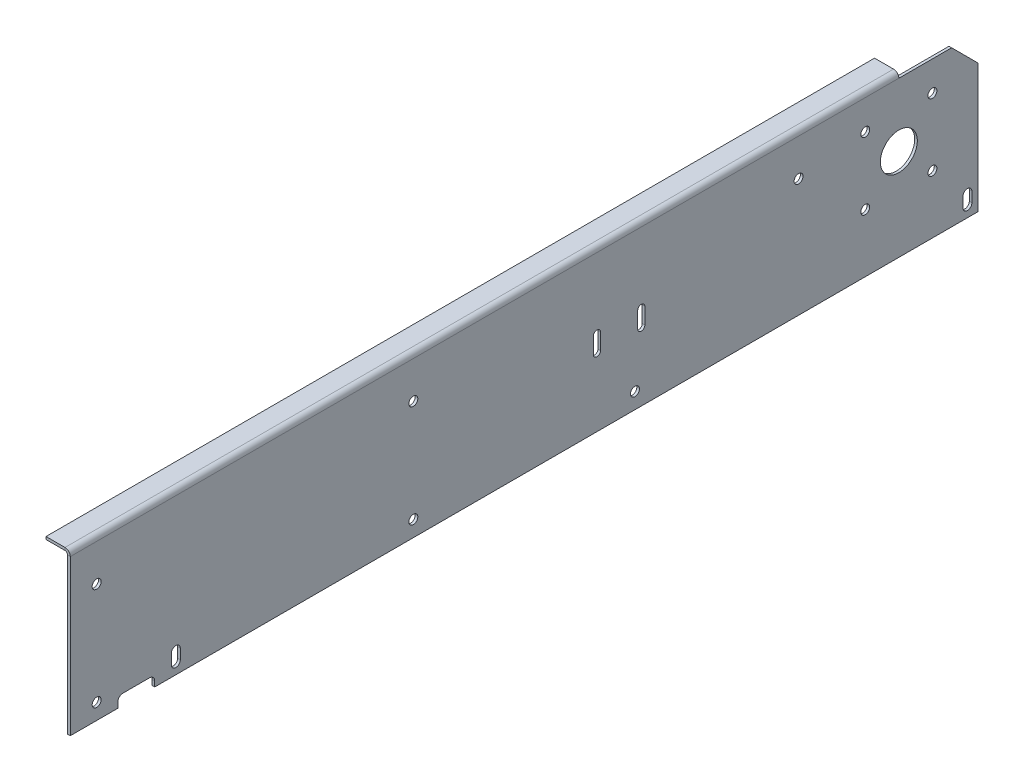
ISO-10303-21;
HEADER;
FILE_DESCRIPTION(('STEP AP214'),'2;1');
FILE_NAME('part.step','',(''),(''),'','','');
FILE_SCHEMA(('AUTOMOTIVE_DESIGN { 1 0 10303 214 1 1 1 1 }'));
ENDSEC;
DATA;
#1=APPLICATION_CONTEXT('core data for automotive mechanical design processes');
#2=APPLICATION_PROTOCOL_DEFINITION('international standard','automotive_design',2000,#1);
#3=PRODUCT_CONTEXT('',#1,'mechanical');
#4=PRODUCT('Part','Part','',(#3));
#5=PRODUCT_RELATED_PRODUCT_CATEGORY('part','',(#4));
#6=PRODUCT_DEFINITION_FORMATION('','',#4);
#7=PRODUCT_DEFINITION_CONTEXT('part definition',#1,'design');
#8=PRODUCT_DEFINITION('design','',#6,#7);
#9=PRODUCT_DEFINITION_SHAPE('','',#8);
#10=(LENGTH_UNIT() NAMED_UNIT(*) SI_UNIT(.MILLI.,.METRE.));
#11=(NAMED_UNIT(*) PLANE_ANGLE_UNIT() SI_UNIT($,.RADIAN.));
#12=(NAMED_UNIT(*) SI_UNIT($,.STERADIAN.) SOLID_ANGLE_UNIT());
#13=UNCERTAINTY_MEASURE_WITH_UNIT(LENGTH_MEASURE(1.E-05),#10,'distance_accuracy_value','');
#14=(GEOMETRIC_REPRESENTATION_CONTEXT(3) GLOBAL_UNCERTAINTY_ASSIGNED_CONTEXT((#13)) GLOBAL_UNIT_ASSIGNED_CONTEXT((#10,
#11,#12)) REPRESENTATION_CONTEXT('',''));
#15=CARTESIAN_POINT('',(0.,0.,0.));
#16=DIRECTION('',(0.,0.,1.));
#17=DIRECTION('',(1.,0.,0.));
#18=AXIS2_PLACEMENT_3D('',#15,#16,#17);
#19=CARTESIAN_POINT('',(0.,0.,430.));
#20=DIRECTION('',(0.,-1.,0.));
#21=DIRECTION('',(0.,0.,-1.));
#22=AXIS2_PLACEMENT_3D('',#19,#20,#21);
#23=PLANE('',#22);
#24=DIRECTION('',(1.,0.,0.));
#25=VECTOR('',#24,1.);
#26=CARTESIAN_POINT('',(-23.001,0.,385.));
#27=LINE('',#26,#25);
#28=CARTESIAN_POINT('',(-2.5,0.,385.));
#29=VERTEX_POINT('',#28);
#30=CARTESIAN_POINT('',(0.,0.,385.));
#31=VERTEX_POINT('',#30);
#32=EDGE_CURVE('E468',#29,#31,#27,.T.);
#33=ORIENTED_EDGE('',*,*,#32,.T.);
#34=DIRECTION('',(0.,0.,-1.));
#35=VECTOR('',#34,1.);
#36=CARTESIAN_POINT('',(0.,0.,430.));
#37=LINE('',#36,#35);
#38=CARTESIAN_POINT('',(0.,0.,430.));
#39=VERTEX_POINT('',#38);
#40=EDGE_CURVE('E659',#39,#31,#37,.T.);
#41=ORIENTED_EDGE('',*,*,#40,.F.);
#42=DIRECTION('',(-1.,0.,0.));
#43=VECTOR('',#42,1.);
#44=CARTESIAN_POINT('',(0.,0.,430.));
#45=LINE('',#44,#43);
#46=CARTESIAN_POINT('',(-2.5,0.,430.));
#47=VERTEX_POINT('',#46);
#48=EDGE_CURVE('E638',#39,#47,#45,.T.);
#49=ORIENTED_EDGE('',*,*,#48,.T.);
#50=DIRECTION('',(0.,0.,-1.));
#51=VECTOR('',#50,1.);
#52=CARTESIAN_POINT('',(-2.5,0.,430.));
#53=LINE('',#52,#51);
#54=EDGE_CURVE('E664',#47,#29,#53,.T.);
#55=ORIENTED_EDGE('',*,*,#54,.T.);
#56=EDGE_LOOP('',(#33,#41,#49,#55));
#57=FACE_BOUND('',#56,.T.);
#58=ADVANCED_FACE('F42',(#57),#23,.T.);
#59=CARTESIAN_POINT('',(0.,152.,430.));
#60=DIRECTION('',(0.,-1.,0.));
#61=DIRECTION('',(1.,0.,0.));
#62=AXIS2_PLACEMENT_3D('',#59,#60,#61);
#63=PLANE('',#62);
#64=DIRECTION('',(1.,0.,0.));
#65=VECTOR('',#64,1.);
#66=CARTESIAN_POINT('',(0.,152.,-355.));
#67=LINE('',#66,#65);
#68=CARTESIAN_POINT('',(-23.,152.,-355.));
#69=VERTEX_POINT('',#68);
#70=CARTESIAN_POINT('',(-5.00000000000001,152.,-355.));
#71=VERTEX_POINT('',#70);
#72=EDGE_CURVE('E598',#69,#71,#67,.T.);
#73=ORIENTED_EDGE('',*,*,#72,.F.);
#74=DIRECTION('',(0.,0.,-1.));
#75=VECTOR('',#74,1.);
#76=CARTESIAN_POINT('',(-23.,152.,430.));
#77=LINE('',#76,#75);
#78=CARTESIAN_POINT('',(-23.,152.,430.));
#79=VERTEX_POINT('',#78);
#80=EDGE_CURVE('E680',#79,#69,#77,.T.);
#81=ORIENTED_EDGE('',*,*,#80,.F.);
#82=DIRECTION('',(-1.,0.,0.));
#83=VECTOR('',#82,1.);
#84=CARTESIAN_POINT('',(0.,152.,430.));
#85=LINE('',#84,#83);
#86=CARTESIAN_POINT('',(-5.00000000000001,152.,430.));
#87=VERTEX_POINT('',#86);
#88=EDGE_CURVE('E620',#87,#79,#85,.T.);
#89=ORIENTED_EDGE('',*,*,#88,.F.);
#90=DIRECTION('',(0.,0.,-1.));
#91=VECTOR('',#90,1.);
#92=CARTESIAN_POINT('',(-5.00000000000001,152.,430.));
#93=LINE('',#92,#91);
#94=EDGE_CURVE('E650',#87,#71,#93,.T.);
#95=ORIENTED_EDGE('',*,*,#94,.T.);
#96=EDGE_LOOP('',(#73,#81,#89,#95));
#97=FACE_BOUND('',#96,.T.);
#98=ADVANCED_FACE('F787',(#97),#63,.F.);
#99=CARTESIAN_POINT('',(-23.,149.5,430.));
#100=DIRECTION('',(-1.,0.,0.));
#101=DIRECTION('',(0.,-1.,0.));
#102=AXIS2_PLACEMENT_3D('',#99,#100,#101);
#103=PLANE('',#102);
#104=ORIENTED_EDGE('',*,*,#80,.T.);
#105=DIRECTION('',(0.,-1.,0.));
#106=VECTOR('',#105,1.);
#107=CARTESIAN_POINT('',(-23.,149.5,-355.));
#108=LINE('',#107,#106);
#109=CARTESIAN_POINT('',(-23.,149.5,-355.));
#110=VERTEX_POINT('',#109);
#111=EDGE_CURVE('E601',#110,#69,#108,.F.);
#112=ORIENTED_EDGE('',*,*,#111,.F.);
#113=DIRECTION('',(0.,0.,-1.));
#114=VECTOR('',#113,1.);
#115=CARTESIAN_POINT('',(-23.,149.5,430.));
#116=LINE('',#115,#114);
#117=CARTESIAN_POINT('',(-23.,149.5,430.));
#118=VERTEX_POINT('',#117);
#119=EDGE_CURVE('E676',#118,#110,#116,.T.);
#120=ORIENTED_EDGE('',*,*,#119,.F.);
#121=DIRECTION('',(0.,1.,0.));
#122=VECTOR('',#121,1.);
#123=CARTESIAN_POINT('',(-23.,149.5,430.));
#124=LINE('',#123,#122);
#125=EDGE_CURVE('E622',#118,#79,#124,.T.);
#126=ORIENTED_EDGE('',*,*,#125,.T.);
#127=EDGE_LOOP('',(#104,#112,#120,#126));
#128=FACE_BOUND('',#127,.T.);
#129=ADVANCED_FACE('F793',(#128),#103,.T.);
#130=CARTESIAN_POINT('',(0.,149.5,430.));
#131=DIRECTION('',(0.,-1.,0.));
#132=DIRECTION('',(1.,0.,0.));
#133=AXIS2_PLACEMENT_3D('',#130,#131,#132);
#134=PLANE('',#133);
#135=ORIENTED_EDGE('',*,*,#119,.T.);
#136=DIRECTION('',(1.,0.,0.));
#137=VECTOR('',#136,1.);
#138=CARTESIAN_POINT('',(0.,149.5,-355.));
#139=LINE('',#138,#137);
#140=CARTESIAN_POINT('',(-5.,149.5,-355.));
#141=VERTEX_POINT('',#140);
#142=EDGE_CURVE('E594',#110,#141,#139,.T.);
#143=ORIENTED_EDGE('',*,*,#142,.T.);
#144=DIRECTION('',(0.,0.,-1.));
#145=VECTOR('',#144,1.);
#146=CARTESIAN_POINT('',(-5.,149.5,430.));
#147=LINE('',#146,#145);
#148=CARTESIAN_POINT('',(-5.,149.5,430.));
#149=VERTEX_POINT('',#148);
#150=EDGE_CURVE('E672',#149,#141,#147,.T.);
#151=ORIENTED_EDGE('',*,*,#150,.F.);
#152=DIRECTION('',(-1.,0.,0.));
#153=VECTOR('',#152,1.);
#154=CARTESIAN_POINT('',(0.,149.5,430.));
#155=LINE('',#154,#153);
#156=EDGE_CURVE('E626',#149,#118,#155,.T.);
#157=ORIENTED_EDGE('',*,*,#156,.T.);
#158=EDGE_LOOP('',(#135,#143,#151,#157));
#159=FACE_BOUND('',#158,.T.);
#160=ADVANCED_FACE('F835',(#159),#134,.T.);
#161=CARTESIAN_POINT('',(-5.,147.,430.));
#162=DIRECTION('',(0.,0.,-1.));
#163=DIRECTION('',(-1.,0.,0.));
#164=AXIS2_PLACEMENT_3D('',#161,#162,#163);
#165=CYLINDRICAL_SURFACE('',#164,2.5);
#166=ORIENTED_EDGE('',*,*,#150,.T.);
#167=CARTESIAN_POINT('',(-5.,147.,-355.));
#168=DIRECTION('',(0.,0.,-1.));
#169=DIRECTION('',(-1.,0.,0.));
#170=AXIS2_PLACEMENT_3D('',#167,#168,#169);
#171=CIRCLE('',#170,2.5);
#172=CARTESIAN_POINT('',(-2.5,147.,-355.));
#173=VERTEX_POINT('',#172);
#174=EDGE_CURVE('E575',#141,#173,#171,.T.);
#175=ORIENTED_EDGE('',*,*,#174,.T.);
#176=DIRECTION('',(0.,0.,-1.));
#177=VECTOR('',#176,1.);
#178=CARTESIAN_POINT('',(-2.5,147.,430.));
#179=LINE('',#178,#177);
#180=CARTESIAN_POINT('',(-2.5,147.,430.));
#181=VERTEX_POINT('',#180);
#182=EDGE_CURVE('E668',#181,#173,#179,.T.);
#183=ORIENTED_EDGE('',*,*,#182,.F.);
#184=CARTESIAN_POINT('',(-5.,147.,430.));
#185=DIRECTION('',(0.,0.,1.));
#186=DIRECTION('',(1.,0.,0.));
#187=AXIS2_PLACEMENT_3D('',#184,#185,#186);
#188=CIRCLE('',#187,2.5);
#189=EDGE_CURVE('E630',#181,#149,#188,.T.);
#190=ORIENTED_EDGE('',*,*,#189,.T.);
#191=EDGE_LOOP('',(#166,#175,#183,#190));
#192=FACE_BOUND('',#191,.T.);
#193=ADVANCED_FACE('F829',(#192),#165,.F.);
#194=CARTESIAN_POINT('',(-5.,147.,430.));
#195=DIRECTION('',(0.,0.,-1.));
#196=DIRECTION('',(-1.,0.,0.));
#197=AXIS2_PLACEMENT_3D('',#194,#195,#196);
#198=CYLINDRICAL_SURFACE('',#197,5.);
#199=CARTESIAN_POINT('',(-5.,147.,-355.));
#200=DIRECTION('',(0.,0.,-1.));
#201=DIRECTION('',(-1.,0.,0.));
#202=AXIS2_PLACEMENT_3D('',#199,#200,#201);
#203=CIRCLE('',#202,5.);
#204=CARTESIAN_POINT('',(0.,147.,-355.));
#205=VERTEX_POINT('',#204);
#206=EDGE_CURVE('E583',#71,#205,#203,.T.);
#207=ORIENTED_EDGE('',*,*,#206,.F.);
#208=ORIENTED_EDGE('',*,*,#94,.F.);
#209=CARTESIAN_POINT('',(-5.,147.,430.));
#210=DIRECTION('',(0.,0.,-1.));
#211=DIRECTION('',(-1.,0.,0.));
#212=AXIS2_PLACEMENT_3D('',#209,#210,#211);
#213=CIRCLE('',#212,5.);
#214=CARTESIAN_POINT('',(0.,147.,430.));
#215=VERTEX_POINT('',#214);
#216=EDGE_CURVE('E646',#215,#87,#213,.F.);
#217=ORIENTED_EDGE('',*,*,#216,.F.);
#218=DIRECTION('',(0.,0.,-1.));
#219=VECTOR('',#218,1.);
#220=CARTESIAN_POINT('',(0.,147.,430.));
#221=LINE('',#220,#219);
#222=EDGE_CURVE('E654',#215,#205,#221,.T.);
#223=ORIENTED_EDGE('',*,*,#222,.T.);
#224=EDGE_LOOP('',(#207,#208,#217,#223));
#225=FACE_BOUND('',#224,.T.);
#226=ADVANCED_FACE('F847',(#225),#198,.T.);
#227=CARTESIAN_POINT('',(0.,147.,430.));
#228=DIRECTION('',(0.,0.,1.));
#229=DIRECTION('',(1.,0.,0.));
#230=AXIS2_PLACEMENT_3D('',#227,#228,#229);
#231=PLANE('',#230);
#232=DIRECTION('',(-1.,0.,0.));
#233=VECTOR('',#232,1.);
#234=CARTESIAN_POINT('',(0.,147.,430.));
#235=LINE('',#234,#233);
#236=EDGE_CURVE('E687',#215,#181,#235,.T.);
#237=ORIENTED_EDGE('',*,*,#236,.F.);
#238=ORIENTED_EDGE('',*,*,#216,.T.);
#239=DIRECTION('',(0.,1.,0.));
#240=VECTOR('',#239,1.);
#241=CARTESIAN_POINT('',(-5.,149.5,430.));
#242=LINE('',#241,#240);
#243=EDGE_CURVE('E684',#149,#87,#242,.T.);
#244=ORIENTED_EDGE('',*,*,#243,.F.);
#245=ORIENTED_EDGE('',*,*,#189,.F.);
#246=EDGE_LOOP('',(#237,#238,#244,#245));
#247=FACE_BOUND('',#246,.T.);
#248=ADVANCED_FACE('F44',(#247),#231,.T.);
#249=CARTESIAN_POINT('',(-5.,149.5,430.));
#250=DIRECTION('',(0.,0.,1.));
#251=DIRECTION('',(1.,0.,0.));
#252=AXIS2_PLACEMENT_3D('',#249,#250,#251);
#253=PLANE('',#252);
#254=DIRECTION('',(0.,1.,0.));
#255=VECTOR('',#254,1.);
#256=CARTESIAN_POINT('',(0.,0.,430.));
#257=LINE('',#256,#255);
#258=EDGE_CURVE('E642',#39,#215,#257,.T.);
#259=ORIENTED_EDGE('',*,*,#258,.T.);
#260=ORIENTED_EDGE('',*,*,#236,.T.);
#261=DIRECTION('',(0.,1.,0.));
#262=VECTOR('',#261,1.);
#263=CARTESIAN_POINT('',(-2.5,0.,430.));
#264=LINE('',#263,#262);
#265=EDGE_CURVE('E634',#47,#181,#264,.T.);
#266=ORIENTED_EDGE('',*,*,#265,.F.);
#267=ORIENTED_EDGE('',*,*,#48,.F.);
#268=EDGE_LOOP('',(#259,#260,#266,#267));
#269=FACE_BOUND('',#268,.T.);
#270=ADVANCED_FACE('F801',(#269),#253,.T.);
#271=CARTESIAN_POINT('',(-2.5,0.,430.));
#272=DIRECTION('',(-1.,0.,0.));
#273=DIRECTION('',(0.,0.,1.));
#274=AXIS2_PLACEMENT_3D('',#271,#272,#273);
#275=PLANE('',#274);
#276=CARTESIAN_POINT('',(-2.5,80.1,-69.));
#277=DIRECTION('',(-1.,0.,0.));
#278=DIRECTION('',(0.,0.,1.));
#279=AXIS2_PLACEMENT_3D('',#276,#277,#278);
#280=CIRCLE('',#279,3.4);
#281=CARTESIAN_POINT('',(-2.5,80.1,-72.4));
#282=VERTEX_POINT('',#281);
#283=CARTESIAN_POINT('',(-2.5,80.1,-65.6));
#284=VERTEX_POINT('',#283);
#285=EDGE_CURVE('E262',#282,#284,#280,.F.);
#286=ORIENTED_EDGE('',*,*,#285,.T.);
#287=DIRECTION('',(0.,-1.,0.));
#288=VECTOR('',#287,1.);
#289=CARTESIAN_POINT('',(-2.5,80.1,-65.6));
#290=LINE('',#289,#288);
#291=CARTESIAN_POINT('',(-2.5,64.9,-65.6));
#292=VERTEX_POINT('',#291);
#293=EDGE_CURVE('E250',#284,#292,#290,.T.);
#294=ORIENTED_EDGE('',*,*,#293,.T.);
#295=CARTESIAN_POINT('',(-2.5,64.9,-69.));
#296=DIRECTION('',(-1.,0.,0.));
#297=DIRECTION('',(0.,0.,1.));
#298=AXIS2_PLACEMENT_3D('',#295,#296,#297);
#299=CIRCLE('',#298,3.4);
#300=CARTESIAN_POINT('',(-2.5,64.9,-72.4));
#301=VERTEX_POINT('',#300);
#302=EDGE_CURVE('E279',#292,#301,#299,.F.);
#303=ORIENTED_EDGE('',*,*,#302,.T.);
#304=DIRECTION('',(0.,1.,0.));
#305=VECTOR('',#304,1.);
#306=CARTESIAN_POINT('',(-2.5,80.1,-72.4));
#307=LINE('',#306,#305);
#308=EDGE_CURVE('E270',#301,#282,#307,.T.);
#309=ORIENTED_EDGE('',*,*,#308,.T.);
#310=EDGE_LOOP('',(#286,#294,#303,#309));
#311=FACE_BOUND('',#310,.T.);
#312=CARTESIAN_POINT('',(-2.5,80.1,-111.));
#313=DIRECTION('',(-1.,0.,0.));
#314=DIRECTION('',(0.,0.,1.));
#315=AXIS2_PLACEMENT_3D('',#312,#313,#314);
#316=CIRCLE('',#315,3.4);
#317=CARTESIAN_POINT('',(-2.5,80.1,-114.4));
#318=VERTEX_POINT('',#317);
#319=CARTESIAN_POINT('',(-2.5,80.1,-107.6));
#320=VERTEX_POINT('',#319);
#321=EDGE_CURVE('E306',#318,#320,#316,.F.);
#322=ORIENTED_EDGE('',*,*,#321,.T.);
#323=DIRECTION('',(0.,-1.,0.));
#324=VECTOR('',#323,1.);
#325=CARTESIAN_POINT('',(-2.5,80.1,-107.6));
#326=LINE('',#325,#324);
#327=CARTESIAN_POINT('',(-2.5,64.9,-107.6));
#328=VERTEX_POINT('',#327);
#329=EDGE_CURVE('E329',#320,#328,#326,.T.);
#330=ORIENTED_EDGE('',*,*,#329,.T.);
#331=CARTESIAN_POINT('',(-2.5,64.9,-111.));
#332=DIRECTION('',(-1.,0.,0.));
#333=DIRECTION('',(0.,0.,1.));
#334=AXIS2_PLACEMENT_3D('',#331,#332,#333);
#335=CIRCLE('',#334,3.4);
#336=CARTESIAN_POINT('',(-2.5,64.9,-114.4));
#337=VERTEX_POINT('',#336);
#338=EDGE_CURVE('E258',#328,#337,#335,.F.);
#339=ORIENTED_EDGE('',*,*,#338,.T.);
#340=DIRECTION('',(0.,1.,0.));
#341=VECTOR('',#340,1.);
#342=CARTESIAN_POINT('',(-2.5,80.1,-114.4));
#343=LINE('',#342,#341);
#344=EDGE_CURVE('E302',#337,#318,#343,.T.);
#345=ORIENTED_EDGE('',*,*,#344,.T.);
#346=EDGE_LOOP('',(#322,#330,#339,#345));
#347=FACE_BOUND('',#346,.T.);
#348=CARTESIAN_POINT('',(-2.5,19.75,330.));
#349=DIRECTION('',(-1.,0.,0.));
#350=DIRECTION('',(0.,0.,1.));
#351=AXIS2_PLACEMENT_3D('',#348,#349,#350);
#352=CIRCLE('',#351,4.24999999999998);
#353=CARTESIAN_POINT('',(-2.5,19.75,325.75));
#354=VERTEX_POINT('',#353);
#355=CARTESIAN_POINT('',(-2.5,19.75,334.25));
#356=VERTEX_POINT('',#355);
#357=EDGE_CURVE('E381',#354,#356,#352,.F.);
#358=ORIENTED_EDGE('',*,*,#357,.T.);
#359=DIRECTION('',(0.,-1.,0.));
#360=VECTOR('',#359,1.);
#361=CARTESIAN_POINT('',(-2.5,19.75,334.25));
#362=LINE('',#361,#360);
#363=CARTESIAN_POINT('',(-2.5,10.25,334.25));
#364=VERTEX_POINT('',#363);
#365=EDGE_CURVE('E345',#356,#364,#362,.T.);
#366=ORIENTED_EDGE('',*,*,#365,.T.);
#367=CARTESIAN_POINT('',(-2.5,10.25,330.));
#368=DIRECTION('',(-1.,0.,0.));
#369=DIRECTION('',(0.,0.,1.));
#370=AXIS2_PLACEMENT_3D('',#367,#368,#369);
#371=CIRCLE('',#370,4.24999999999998);
#372=CARTESIAN_POINT('',(-2.5,10.25,325.75));
#373=VERTEX_POINT('',#372);
#374=EDGE_CURVE('E363',#364,#373,#371,.F.);
#375=ORIENTED_EDGE('',*,*,#374,.T.);
#376=DIRECTION('',(0.,1.,0.));
#377=VECTOR('',#376,1.);
#378=CARTESIAN_POINT('',(-2.5,19.75,325.75));
#379=LINE('',#378,#377);
#380=EDGE_CURVE('E374',#373,#354,#379,.T.);
#381=ORIENTED_EDGE('',*,*,#380,.T.);
#382=EDGE_LOOP('',(#358,#366,#375,#381));
#383=FACE_BOUND('',#382,.T.);
#384=CARTESIAN_POINT('',(-2.5,19.75,-420.));
#385=DIRECTION('',(-1.,0.,0.));
#386=DIRECTION('',(0.,0.,1.));
#387=AXIS2_PLACEMENT_3D('',#384,#385,#386);
#388=CIRCLE('',#387,4.24999999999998);
#389=CARTESIAN_POINT('',(-2.5,19.75,-424.25));
#390=VERTEX_POINT('',#389);
#391=CARTESIAN_POINT('',(-2.5,19.75,-415.75));
#392=VERTEX_POINT('',#391);
#393=EDGE_CURVE('E393',#390,#392,#388,.F.);
#394=ORIENTED_EDGE('',*,*,#393,.T.);
#395=DIRECTION('',(0.,-1.,0.));
#396=VECTOR('',#395,1.);
#397=CARTESIAN_POINT('',(-2.5,19.75,-415.75));
#398=LINE('',#397,#396);
#399=CARTESIAN_POINT('',(-2.5,10.25,-415.75));
#400=VERTEX_POINT('',#399);
#401=EDGE_CURVE('E416',#392,#400,#398,.T.);
#402=ORIENTED_EDGE('',*,*,#401,.T.);
#403=CARTESIAN_POINT('',(-2.5,10.25,-420.));
#404=DIRECTION('',(-1.,0.,0.));
#405=DIRECTION('',(0.,0.,1.));
#406=AXIS2_PLACEMENT_3D('',#403,#404,#405);
#407=CIRCLE('',#406,4.24999999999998);
#408=CARTESIAN_POINT('',(-2.5,10.25,-424.25));
#409=VERTEX_POINT('',#408);
#410=EDGE_CURVE('E385',#400,#409,#407,.F.);
#411=ORIENTED_EDGE('',*,*,#410,.T.);
#412=DIRECTION('',(0.,1.,0.));
#413=VECTOR('',#412,1.);
#414=CARTESIAN_POINT('',(-2.5,19.75,-424.25));
#415=LINE('',#414,#413);
#416=EDGE_CURVE('E389',#409,#390,#415,.T.);
#417=ORIENTED_EDGE('',*,*,#416,.T.);
#418=EDGE_LOOP('',(#394,#402,#411,#417));
#419=FACE_BOUND('',#418,.T.);
#420=DIRECTION('',(0.,0.,-1.));
#421=VECTOR('',#420,1.);
#422=CARTESIAN_POINT('',(-2.5,147.,430.));
#423=LINE('',#422,#421);
#424=CARTESIAN_POINT('',(-2.5,147.,-405.));
#425=VERTEX_POINT('',#424);
#426=EDGE_CURVE('E579',#173,#425,#423,.T.);
#427=ORIENTED_EDGE('',*,*,#426,.T.);
#428=DIRECTION('',(0.,0.707106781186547,0.707106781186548));
#429=VECTOR('',#428,1.);
#430=CARTESIAN_POINT('',(-2.5,491.,-60.9999999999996));
#431=LINE('',#430,#429);
#432=CARTESIAN_POINT('',(-2.5,122.,-430.));
#433=VERTEX_POINT('',#432);
#434=EDGE_CURVE('E11',#425,#433,#431,.F.);
#435=ORIENTED_EDGE('',*,*,#434,.T.);
#436=DIRECTION('',(0.,1.,0.));
#437=VECTOR('',#436,1.);
#438=CARTESIAN_POINT('',(-2.5,0.,-430.));
#439=LINE('',#438,#437);
#440=CARTESIAN_POINT('',(-2.5,0.,-430.));
#441=VERTEX_POINT('',#440);
#442=EDGE_CURVE('E606',#441,#433,#439,.T.);
#443=ORIENTED_EDGE('',*,*,#442,.F.);
#444=CARTESIAN_POINT('',(-2.50000000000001,0.,350.));
#445=VERTEX_POINT('',#444);
#446=EDGE_CURVE('E663',#445,#441,#53,.T.);
#447=ORIENTED_EDGE('',*,*,#446,.F.);
#448=DIRECTION('',(0.,1.,0.));
#449=VECTOR('',#448,1.);
#450=CARTESIAN_POINT('',(-2.5,0.,350.));
#451=LINE('',#450,#449);
#452=CARTESIAN_POINT('',(-2.5,5.,350.));
#453=VERTEX_POINT('',#452);
#454=EDGE_CURVE('E429',#445,#453,#451,.T.);
#455=ORIENTED_EDGE('',*,*,#454,.T.);
#456=CARTESIAN_POINT('',(-2.5,5.,355.));
#457=DIRECTION('',(-1.,0.,0.));
#458=DIRECTION('',(0.,0.,1.));
#459=AXIS2_PLACEMENT_3D('',#456,#457,#458);
#460=CIRCLE('',#459,5.);
#461=CARTESIAN_POINT('',(-2.5,10.,355.));
#462=VERTEX_POINT('',#461);
#463=EDGE_CURVE('E433',#453,#462,#460,.F.);
#464=ORIENTED_EDGE('',*,*,#463,.T.);
#465=DIRECTION('',(0.,0.,1.));
#466=VECTOR('',#465,1.);
#467=CARTESIAN_POINT('',(-2.5,10.,380.));
#468=LINE('',#467,#466);
#469=CARTESIAN_POINT('',(-2.5,10.,380.));
#470=VERTEX_POINT('',#469);
#471=EDGE_CURVE('E437',#462,#470,#468,.T.);
#472=ORIENTED_EDGE('',*,*,#471,.T.);
#473=CARTESIAN_POINT('',(-2.5,5.,380.));
#474=DIRECTION('',(-1.,0.,0.));
#475=DIRECTION('',(0.,0.,1.));
#476=AXIS2_PLACEMENT_3D('',#473,#474,#475);
#477=CIRCLE('',#476,5.);
#478=CARTESIAN_POINT('',(-2.5,5.,385.));
#479=VERTEX_POINT('',#478);
#480=EDGE_CURVE('E441',#470,#479,#477,.F.);
#481=ORIENTED_EDGE('',*,*,#480,.T.);
#482=DIRECTION('',(0.,-1.,0.));
#483=VECTOR('',#482,1.);
#484=CARTESIAN_POINT('',(-2.5,0.,385.));
#485=LINE('',#484,#483);
#486=EDGE_CURVE('E445',#479,#29,#485,.T.);
#487=ORIENTED_EDGE('',*,*,#486,.T.);
#488=ORIENTED_EDGE('',*,*,#54,.F.);
#489=ORIENTED_EDGE('',*,*,#265,.T.);
#490=ORIENTED_EDGE('',*,*,#182,.T.);
#491=EDGE_LOOP('',(#427,#435,#443,#447,#455,#464,#472,#481,#487,#488,#489,#490));
#492=FACE_BOUND('',#491,.T.);
#493=CARTESIAN_POINT('',(-2.5,112.,-260.));
#494=DIRECTION('',(-1.,0.,0.));
#495=DIRECTION('',(0.,0.,1.));
#496=AXIS2_PLACEMENT_3D('',#493,#494,#495);
#497=CIRCLE('',#496,4.24999999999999);
#498=CARTESIAN_POINT('',(-2.5,112.,-255.75));
#499=VERTEX_POINT('',#498);
#500=EDGE_CURVE('E491',#499,#499,#497,.T.);
#501=ORIENTED_EDGE('',*,*,#500,.F.);
#502=EDGE_LOOP('',(#501));
#503=FACE_BOUND('',#502,.T.);
#504=CARTESIAN_POINT('',(-2.5,15.,-105.));
#505=DIRECTION('',(-1.,0.,0.));
#506=DIRECTION('',(0.,0.,1.));
#507=AXIS2_PLACEMENT_3D('',#504,#505,#506);
#508=CIRCLE('',#507,4.24999999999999);
#509=CARTESIAN_POINT('',(-2.5,15.,-100.75));
#510=VERTEX_POINT('',#509);
#511=EDGE_CURVE('E499',#510,#510,#508,.T.);
#512=ORIENTED_EDGE('',*,*,#511,.F.);
#513=EDGE_LOOP('',(#512));
#514=FACE_BOUND('',#513,.T.);
#515=CARTESIAN_POINT('',(-2.5,112.,105.));
#516=DIRECTION('',(-1.,0.,0.));
#517=DIRECTION('',(0.,0.,1.));
#518=AXIS2_PLACEMENT_3D('',#515,#516,#517);
#519=CIRCLE('',#518,4.24999999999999);
#520=CARTESIAN_POINT('',(-2.5,112.,109.25));
#521=VERTEX_POINT('',#520);
#522=EDGE_CURVE('E507',#521,#521,#519,.T.);
#523=ORIENTED_EDGE('',*,*,#522,.F.);
#524=EDGE_LOOP('',(#523));
#525=FACE_BOUND('',#524,.T.);
#526=CARTESIAN_POINT('',(-2.5,15.,105.));
#527=DIRECTION('',(-1.,0.,0.));
#528=DIRECTION('',(0.,0.,1.));
#529=AXIS2_PLACEMENT_3D('',#526,#527,#528);
#530=CIRCLE('',#529,4.24999999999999);
#531=CARTESIAN_POINT('',(-2.5,15.,109.25));
#532=VERTEX_POINT('',#531);
#533=EDGE_CURVE('E515',#532,#532,#530,.T.);
#534=ORIENTED_EDGE('',*,*,#533,.F.);
#535=EDGE_LOOP('',(#534));
#536=FACE_BOUND('',#535,.T.);
#537=CARTESIAN_POINT('',(-2.5,112.,405.));
#538=DIRECTION('',(-1.,0.,0.));
#539=DIRECTION('',(0.,0.,1.));
#540=AXIS2_PLACEMENT_3D('',#537,#538,#539);
#541=CIRCLE('',#540,4.24999999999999);
#542=CARTESIAN_POINT('',(-2.5,112.,409.25));
#543=VERTEX_POINT('',#542);
#544=EDGE_CURVE('E523',#543,#543,#541,.T.);
#545=ORIENTED_EDGE('',*,*,#544,.F.);
#546=EDGE_LOOP('',(#545));
#547=FACE_BOUND('',#546,.T.);
#548=CARTESIAN_POINT('',(-2.5,15.,405.));
#549=DIRECTION('',(-1.,0.,0.));
#550=DIRECTION('',(0.,0.,1.));
#551=AXIS2_PLACEMENT_3D('',#548,#549,#550);
#552=CIRCLE('',#551,4.24999999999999);
#553=CARTESIAN_POINT('',(-2.5,15.,409.25));
#554=VERTEX_POINT('',#553);
#555=EDGE_CURVE('E531',#554,#554,#552,.T.);
#556=ORIENTED_EDGE('',*,*,#555,.F.);
#557=EDGE_LOOP('',(#556));
#558=FACE_BOUND('',#557,.T.);
#559=CARTESIAN_POINT('',(-2.5,55.1801948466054,-323.180194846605));
#560=DIRECTION('',(-1.,0.,0.));
#561=DIRECTION('',(0.,0.,1.));
#562=AXIS2_PLACEMENT_3D('',#559,#560,#561);
#563=CIRCLE('',#562,4.24999999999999);
#564=CARTESIAN_POINT('',(-2.5,55.1801948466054,-318.930194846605));
#565=VERTEX_POINT('',#564);
#566=EDGE_CURVE('E539',#565,#565,#563,.T.);
#567=ORIENTED_EDGE('',*,*,#566,.F.);
#568=EDGE_LOOP('',(#567));
#569=FACE_BOUND('',#568,.T.);
#570=CARTESIAN_POINT('',(-2.5,118.819805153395,-323.180194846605));
#571=DIRECTION('',(-1.,0.,0.));
#572=DIRECTION('',(0.,0.,1.));
#573=AXIS2_PLACEMENT_3D('',#570,#571,#572);
#574=CIRCLE('',#573,4.24999999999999);
#575=CARTESIAN_POINT('',(-2.5,118.819805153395,-318.930194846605));
#576=VERTEX_POINT('',#575);
#577=EDGE_CURVE('E547',#576,#576,#574,.T.);
#578=ORIENTED_EDGE('',*,*,#577,.F.);
#579=EDGE_LOOP('',(#578));
#580=FACE_BOUND('',#579,.T.);
#581=CARTESIAN_POINT('',(-2.5,118.819805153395,-386.819805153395));
#582=DIRECTION('',(-1.,0.,0.));
#583=DIRECTION('',(0.,0.,1.));
#584=AXIS2_PLACEMENT_3D('',#581,#582,#583);
#585=CIRCLE('',#584,4.24999999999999);
#586=CARTESIAN_POINT('',(-2.5,118.819805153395,-382.569805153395));
#587=VERTEX_POINT('',#586);
#588=EDGE_CURVE('E555',#587,#587,#585,.T.);
#589=ORIENTED_EDGE('',*,*,#588,.F.);
#590=EDGE_LOOP('',(#589));
#591=FACE_BOUND('',#590,.T.);
#592=CARTESIAN_POINT('',(-2.5,55.1801948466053,-386.819805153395));
#593=DIRECTION('',(-1.,0.,0.));
#594=DIRECTION('',(0.,0.,1.));
#595=AXIS2_PLACEMENT_3D('',#592,#593,#594);
#596=CIRCLE('',#595,4.24999999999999);
#597=CARTESIAN_POINT('',(-2.5,55.1801948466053,-382.569805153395));
#598=VERTEX_POINT('',#597);
#599=EDGE_CURVE('E563',#598,#598,#596,.T.);
#600=ORIENTED_EDGE('',*,*,#599,.F.);
#601=EDGE_LOOP('',(#600));
#602=FACE_BOUND('',#601,.T.);
#603=CARTESIAN_POINT('',(-2.5,87.,-355.));
#604=DIRECTION('',(-1.,0.,0.));
#605=DIRECTION('',(0.,0.,1.));
#606=AXIS2_PLACEMENT_3D('',#603,#604,#605);
#607=CIRCLE('',#606,17.4999999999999);
#608=CARTESIAN_POINT('',(-2.5,87.,-337.5));
#609=VERTEX_POINT('',#608);
#610=EDGE_CURVE('E567',#609,#609,#607,.T.);
#611=ORIENTED_EDGE('',*,*,#610,.F.);
#612=EDGE_LOOP('',(#611));
#613=FACE_BOUND('',#612,.T.);
#614=ADVANCED_FACE('F268',(#311,#347,#383,#419,#492,#503,#514,#525,#536,#547,#558,#569,#580,
#591,#602,#613),#275,.T.);
#615=DIRECTION('',(1.,0.,0.));
#616=VECTOR('',#615,1.);
#617=CARTESIAN_POINT('',(-23.001,0.,350.));
#618=LINE('',#617,#616);
#619=CARTESIAN_POINT('',(0.,0.,350.));
#620=VERTEX_POINT('',#619);
#621=EDGE_CURVE('E482',#445,#620,#618,.T.);
#622=ORIENTED_EDGE('',*,*,#621,.F.);
#623=ORIENTED_EDGE('',*,*,#446,.T.);
#624=DIRECTION('',(-1.,0.,0.));
#625=VECTOR('',#624,1.);
#626=CARTESIAN_POINT('',(0.,0.,-430.));
#627=LINE('',#626,#625);
#628=CARTESIAN_POINT('',(0.,0.,-430.));
#629=VERTEX_POINT('',#628);
#630=EDGE_CURVE('E612',#629,#441,#627,.T.);
#631=ORIENTED_EDGE('',*,*,#630,.F.);
#632=EDGE_CURVE('E658',#620,#629,#37,.T.);
#633=ORIENTED_EDGE('',*,*,#632,.F.);
#634=EDGE_LOOP('',(#622,#623,#631,#633));
#635=FACE_BOUND('',#634,.T.);
#636=ADVANCED_FACE('F735',(#635),#23,.T.);
#637=CARTESIAN_POINT('',(0.,0.,430.));
#638=DIRECTION('',(-1.,0.,0.));
#639=DIRECTION('',(0.,0.,1.));
#640=AXIS2_PLACEMENT_3D('',#637,#638,#639);
#641=PLANE('',#640);
#642=DIRECTION('',(0.,-1.,0.));
#643=VECTOR('',#642,1.);
#644=CARTESIAN_POINT('',(0.,80.1,-65.6));
#645=LINE('',#644,#643);
#646=CARTESIAN_POINT('',(0.,80.1,-65.6));
#647=VERTEX_POINT('',#646);
#648=CARTESIAN_POINT('',(0.,64.9,-65.6));
#649=VERTEX_POINT('',#648);
#650=EDGE_CURVE('E276',#647,#649,#645,.T.);
#651=ORIENTED_EDGE('',*,*,#650,.F.);
#652=CARTESIAN_POINT('',(0.,80.1,-69.));
#653=DIRECTION('',(1.,0.,0.));
#654=DIRECTION('',(0.,0.,1.));
#655=AXIS2_PLACEMENT_3D('',#652,#653,#654);
#656=CIRCLE('',#655,3.4);
#657=CARTESIAN_POINT('',(0.,80.1,-72.4));
#658=VERTEX_POINT('',#657);
#659=EDGE_CURVE('E66',#658,#647,#656,.T.);
#660=ORIENTED_EDGE('',*,*,#659,.F.);
#661=DIRECTION('',(0.,1.,0.));
#662=VECTOR('',#661,1.);
#663=CARTESIAN_POINT('',(0.,80.1,-72.4));
#664=LINE('',#663,#662);
#665=CARTESIAN_POINT('',(0.,64.9,-72.4));
#666=VERTEX_POINT('',#665);
#667=EDGE_CURVE('E265',#666,#658,#664,.T.);
#668=ORIENTED_EDGE('',*,*,#667,.F.);
#669=CARTESIAN_POINT('',(0.,64.9,-69.));
#670=DIRECTION('',(1.,0.,0.));
#671=DIRECTION('',(0.,0.,-1.));
#672=AXIS2_PLACEMENT_3D('',#669,#670,#671);
#673=CIRCLE('',#672,3.4);
#674=EDGE_CURVE('E285',#649,#666,#673,.T.);
#675=ORIENTED_EDGE('',*,*,#674,.F.);
#676=EDGE_LOOP('',(#651,#660,#668,#675));
#677=FACE_BOUND('',#676,.T.);
#678=DIRECTION('',(0.,-1.,0.));
#679=VECTOR('',#678,1.);
#680=CARTESIAN_POINT('',(0.,80.1,-107.6));
#681=LINE('',#680,#679);
#682=CARTESIAN_POINT('',(0.,80.1,-107.6));
#683=VERTEX_POINT('',#682);
#684=CARTESIAN_POINT('',(0.,64.9,-107.6));
#685=VERTEX_POINT('',#684);
#686=EDGE_CURVE('E313',#683,#685,#681,.T.);
#687=ORIENTED_EDGE('',*,*,#686,.F.);
#688=CARTESIAN_POINT('',(0.,80.1,-111.));
#689=DIRECTION('',(1.,0.,0.));
#690=DIRECTION('',(0.,0.,1.));
#691=AXIS2_PLACEMENT_3D('',#688,#689,#690);
#692=CIRCLE('',#691,3.4);
#693=CARTESIAN_POINT('',(0.,80.1,-114.4));
#694=VERTEX_POINT('',#693);
#695=EDGE_CURVE('E310',#694,#683,#692,.T.);
#696=ORIENTED_EDGE('',*,*,#695,.F.);
#697=DIRECTION('',(0.,1.,0.));
#698=VECTOR('',#697,1.);
#699=CARTESIAN_POINT('',(0.,80.1,-114.4));
#700=LINE('',#699,#698);
#701=CARTESIAN_POINT('',(0.,64.9,-114.4));
#702=VERTEX_POINT('',#701);
#703=EDGE_CURVE('E321',#702,#694,#700,.T.);
#704=ORIENTED_EDGE('',*,*,#703,.F.);
#705=CARTESIAN_POINT('',(0.,64.9,-111.));
#706=DIRECTION('',(1.,0.,0.));
#707=DIRECTION('',(0.,0.,-1.));
#708=AXIS2_PLACEMENT_3D('',#705,#706,#707);
#709=CIRCLE('',#708,3.4);
#710=EDGE_CURVE('E317',#685,#702,#709,.T.);
#711=ORIENTED_EDGE('',*,*,#710,.F.);
#712=EDGE_LOOP('',(#687,#696,#704,#711));
#713=FACE_BOUND('',#712,.T.);
#714=DIRECTION('',(0.,-1.,0.));
#715=VECTOR('',#714,1.);
#716=CARTESIAN_POINT('',(0.,19.75,334.25));
#717=LINE('',#716,#715);
#718=CARTESIAN_POINT('',(0.,19.75,334.25));
#719=VERTEX_POINT('',#718);
#720=CARTESIAN_POINT('',(0.,10.25,334.25));
#721=VERTEX_POINT('',#720);
#722=EDGE_CURVE('E342',#719,#721,#717,.T.);
#723=ORIENTED_EDGE('',*,*,#722,.F.);
#724=CARTESIAN_POINT('',(0.,19.75,330.));
#725=DIRECTION('',(1.,0.,0.));
#726=DIRECTION('',(0.,0.,1.));
#727=AXIS2_PLACEMENT_3D('',#724,#725,#726);
#728=CIRCLE('',#727,4.24999999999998);
#729=CARTESIAN_POINT('',(0.,19.75,325.75));
#730=VERTEX_POINT('',#729);
#731=EDGE_CURVE('E378',#730,#719,#728,.T.);
#732=ORIENTED_EDGE('',*,*,#731,.F.);
#733=DIRECTION('',(0.,1.,0.));
#734=VECTOR('',#733,1.);
#735=CARTESIAN_POINT('',(0.,19.75,325.75));
#736=LINE('',#735,#734);
#737=CARTESIAN_POINT('',(0.,10.25,325.75));
#738=VERTEX_POINT('',#737);
#739=EDGE_CURVE('E367',#738,#730,#736,.T.);
#740=ORIENTED_EDGE('',*,*,#739,.F.);
#741=CARTESIAN_POINT('',(0.,10.25,330.));
#742=DIRECTION('',(1.,0.,0.));
#743=DIRECTION('',(0.,0.,-1.));
#744=AXIS2_PLACEMENT_3D('',#741,#742,#743);
#745=CIRCLE('',#744,4.24999999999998);
#746=EDGE_CURVE('E356',#721,#738,#745,.T.);
#747=ORIENTED_EDGE('',*,*,#746,.F.);
#748=EDGE_LOOP('',(#723,#732,#740,#747));
#749=FACE_BOUND('',#748,.T.);
#750=DIRECTION('',(0.,-1.,0.));
#751=VECTOR('',#750,1.);
#752=CARTESIAN_POINT('',(0.,19.75,-415.75));
#753=LINE('',#752,#751);
#754=CARTESIAN_POINT('',(0.,19.75,-415.75));
#755=VERTEX_POINT('',#754);
#756=CARTESIAN_POINT('',(0.,10.25,-415.75));
#757=VERTEX_POINT('',#756);
#758=EDGE_CURVE('E400',#755,#757,#753,.T.);
#759=ORIENTED_EDGE('',*,*,#758,.F.);
#760=CARTESIAN_POINT('',(0.,19.75,-420.));
#761=DIRECTION('',(1.,0.,0.));
#762=DIRECTION('',(0.,0.,1.));
#763=AXIS2_PLACEMENT_3D('',#760,#761,#762);
#764=CIRCLE('',#763,4.24999999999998);
#765=CARTESIAN_POINT('',(0.,19.75,-424.25));
#766=VERTEX_POINT('',#765);
#767=EDGE_CURVE('E397',#766,#755,#764,.T.);
#768=ORIENTED_EDGE('',*,*,#767,.F.);
#769=DIRECTION('',(0.,1.,0.));
#770=VECTOR('',#769,1.);
#771=CARTESIAN_POINT('',(0.,19.75,-424.25));
#772=LINE('',#771,#770);
#773=CARTESIAN_POINT('',(0.,10.25,-424.25));
#774=VERTEX_POINT('',#773);
#775=EDGE_CURVE('E408',#774,#766,#772,.T.);
#776=ORIENTED_EDGE('',*,*,#775,.F.);
#777=CARTESIAN_POINT('',(0.,10.25,-420.));
#778=DIRECTION('',(1.,0.,0.));
#779=DIRECTION('',(0.,0.,-1.));
#780=AXIS2_PLACEMENT_3D('',#777,#778,#779);
#781=CIRCLE('',#780,4.24999999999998);
#782=EDGE_CURVE('E404',#757,#774,#781,.T.);
#783=ORIENTED_EDGE('',*,*,#782,.F.);
#784=EDGE_LOOP('',(#759,#768,#776,#783));
#785=FACE_BOUND('',#784,.T.);
#786=CARTESIAN_POINT('',(0.,112.,-260.));
#787=DIRECTION('',(1.,0.,0.));
#788=DIRECTION('',(0.,0.,-1.));
#789=AXIS2_PLACEMENT_3D('',#786,#787,#788);
#790=CIRCLE('',#789,4.24999999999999);
#791=CARTESIAN_POINT('',(0.,112.,-264.25));
#792=VERTEX_POINT('',#791);
#793=EDGE_CURVE('E472',#792,#792,#790,.T.);
#794=ORIENTED_EDGE('',*,*,#793,.F.);
#795=EDGE_LOOP('',(#794));
#796=FACE_BOUND('',#795,.T.);
#797=CARTESIAN_POINT('',(0.,15.,-105.));
#798=DIRECTION('',(1.,0.,0.));
#799=DIRECTION('',(0.,0.,-1.));
#800=AXIS2_PLACEMENT_3D('',#797,#798,#799);
#801=CIRCLE('',#800,4.24999999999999);
#802=CARTESIAN_POINT('',(0.,15.,-109.25));
#803=VERTEX_POINT('',#802);
#804=EDGE_CURVE('E495',#803,#803,#801,.T.);
#805=ORIENTED_EDGE('',*,*,#804,.F.);
#806=EDGE_LOOP('',(#805));
#807=FACE_BOUND('',#806,.T.);
#808=CARTESIAN_POINT('',(0.,112.,105.));
#809=DIRECTION('',(1.,0.,0.));
#810=DIRECTION('',(0.,0.,-1.));
#811=AXIS2_PLACEMENT_3D('',#808,#809,#810);
#812=CIRCLE('',#811,4.24999999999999);
#813=CARTESIAN_POINT('',(0.,112.,100.75));
#814=VERTEX_POINT('',#813);
#815=EDGE_CURVE('E503',#814,#814,#812,.T.);
#816=ORIENTED_EDGE('',*,*,#815,.F.);
#817=EDGE_LOOP('',(#816));
#818=FACE_BOUND('',#817,.T.);
#819=CARTESIAN_POINT('',(0.,15.,105.));
#820=DIRECTION('',(1.,0.,0.));
#821=DIRECTION('',(0.,0.,-1.));
#822=AXIS2_PLACEMENT_3D('',#819,#820,#821);
#823=CIRCLE('',#822,4.24999999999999);
#824=CARTESIAN_POINT('',(0.,15.,100.75));
#825=VERTEX_POINT('',#824);
#826=EDGE_CURVE('E511',#825,#825,#823,.T.);
#827=ORIENTED_EDGE('',*,*,#826,.F.);
#828=EDGE_LOOP('',(#827));
#829=FACE_BOUND('',#828,.T.);
#830=CARTESIAN_POINT('',(0.,112.,405.));
#831=DIRECTION('',(1.,0.,0.));
#832=DIRECTION('',(0.,0.,-1.));
#833=AXIS2_PLACEMENT_3D('',#830,#831,#832);
#834=CIRCLE('',#833,4.24999999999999);
#835=CARTESIAN_POINT('',(0.,112.,400.75));
#836=VERTEX_POINT('',#835);
#837=EDGE_CURVE('E519',#836,#836,#834,.T.);
#838=ORIENTED_EDGE('',*,*,#837,.F.);
#839=EDGE_LOOP('',(#838));
#840=FACE_BOUND('',#839,.T.);
#841=CARTESIAN_POINT('',(0.,15.,405.));
#842=DIRECTION('',(1.,0.,0.));
#843=DIRECTION('',(0.,0.,-1.));
#844=AXIS2_PLACEMENT_3D('',#841,#842,#843);
#845=CIRCLE('',#844,4.24999999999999);
#846=CARTESIAN_POINT('',(0.,15.,400.75));
#847=VERTEX_POINT('',#846);
#848=EDGE_CURVE('E527',#847,#847,#845,.T.);
#849=ORIENTED_EDGE('',*,*,#848,.F.);
#850=EDGE_LOOP('',(#849));
#851=FACE_BOUND('',#850,.T.);
#852=CARTESIAN_POINT('',(0.,55.1801948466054,-323.180194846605));
#853=DIRECTION('',(1.,0.,0.));
#854=DIRECTION('',(0.,0.,-1.));
#855=AXIS2_PLACEMENT_3D('',#852,#853,#854);
#856=CIRCLE('',#855,4.24999999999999);
#857=CARTESIAN_POINT('',(0.,55.1801948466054,-327.430194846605));
#858=VERTEX_POINT('',#857);
#859=EDGE_CURVE('E535',#858,#858,#856,.T.);
#860=ORIENTED_EDGE('',*,*,#859,.F.);
#861=EDGE_LOOP('',(#860));
#862=FACE_BOUND('',#861,.T.);
#863=CARTESIAN_POINT('',(0.,118.819805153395,-323.180194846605));
#864=DIRECTION('',(1.,0.,0.));
#865=DIRECTION('',(0.,0.,-1.));
#866=AXIS2_PLACEMENT_3D('',#863,#864,#865);
#867=CIRCLE('',#866,4.24999999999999);
#868=CARTESIAN_POINT('',(0.,118.819805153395,-327.430194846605));
#869=VERTEX_POINT('',#868);
#870=EDGE_CURVE('E543',#869,#869,#867,.T.);
#871=ORIENTED_EDGE('',*,*,#870,.F.);
#872=EDGE_LOOP('',(#871));
#873=FACE_BOUND('',#872,.T.);
#874=CARTESIAN_POINT('',(0.,118.819805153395,-386.819805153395));
#875=DIRECTION('',(1.,0.,0.));
#876=DIRECTION('',(0.,0.,-1.));
#877=AXIS2_PLACEMENT_3D('',#874,#875,#876);
#878=CIRCLE('',#877,4.24999999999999);
#879=CARTESIAN_POINT('',(0.,118.819805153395,-391.069805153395));
#880=VERTEX_POINT('',#879);
#881=EDGE_CURVE('E551',#880,#880,#878,.T.);
#882=ORIENTED_EDGE('',*,*,#881,.F.);
#883=EDGE_LOOP('',(#882));
#884=FACE_BOUND('',#883,.T.);
#885=CARTESIAN_POINT('',(0.,55.1801948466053,-386.819805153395));
#886=DIRECTION('',(1.,0.,0.));
#887=DIRECTION('',(0.,0.,-1.));
#888=AXIS2_PLACEMENT_3D('',#885,#886,#887);
#889=CIRCLE('',#888,4.24999999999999);
#890=CARTESIAN_POINT('',(0.,55.1801948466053,-391.069805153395));
#891=VERTEX_POINT('',#890);
#892=EDGE_CURVE('E559',#891,#891,#889,.T.);
#893=ORIENTED_EDGE('',*,*,#892,.F.);
#894=EDGE_LOOP('',(#893));
#895=FACE_BOUND('',#894,.T.);
#896=CARTESIAN_POINT('',(0.,87.,-355.));
#897=DIRECTION('',(-1.,0.,0.));
#898=DIRECTION('',(0.,0.,1.));
#899=AXIS2_PLACEMENT_3D('',#896,#897,#898);
#900=CIRCLE('',#899,17.4999999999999);
#901=CARTESIAN_POINT('',(0.,87.,-337.5));
#902=VERTEX_POINT('',#901);
#903=EDGE_CURVE('E571',#902,#902,#900,.F.);
#904=ORIENTED_EDGE('',*,*,#903,.F.);
#905=EDGE_LOOP('',(#904));
#906=FACE_BOUND('',#905,.T.);
#907=DIRECTION('',(0.,1.,0.));
#908=VECTOR('',#907,1.);
#909=CARTESIAN_POINT('',(0.,0.,-430.));
#910=LINE('',#909,#908);
#911=CARTESIAN_POINT('',(0.,122.,-430.));
#912=VERTEX_POINT('',#911);
#913=EDGE_CURVE('E616',#629,#912,#910,.T.);
#914=ORIENTED_EDGE('',*,*,#913,.T.);
#915=DIRECTION('',(0.,-0.707106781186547,-0.707106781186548));
#916=VECTOR('',#915,1.);
#917=CARTESIAN_POINT('',(0.,122.,-430.));
#918=LINE('',#917,#916);
#919=CARTESIAN_POINT('',(0.,147.,-405.));
#920=VERTEX_POINT('',#919);
#921=EDGE_CURVE('E694',#912,#920,#918,.F.);
#922=ORIENTED_EDGE('',*,*,#921,.T.);
#923=DIRECTION('',(0.,0.,-1.));
#924=VECTOR('',#923,1.);
#925=CARTESIAN_POINT('',(0.,147.,430.));
#926=LINE('',#925,#924);
#927=EDGE_CURVE('E586',#205,#920,#926,.T.);
#928=ORIENTED_EDGE('',*,*,#927,.F.);
#929=ORIENTED_EDGE('',*,*,#222,.F.);
#930=ORIENTED_EDGE('',*,*,#258,.F.);
#931=ORIENTED_EDGE('',*,*,#40,.T.);
#932=DIRECTION('',(0.,-1.,0.));
#933=VECTOR('',#932,1.);
#934=CARTESIAN_POINT('',(0.,0.,385.));
#935=LINE('',#934,#933);
#936=CARTESIAN_POINT('',(0.,5.,385.));
#937=VERTEX_POINT('',#936);
#938=EDGE_CURVE('E449',#937,#31,#935,.T.);
#939=ORIENTED_EDGE('',*,*,#938,.F.);
#940=CARTESIAN_POINT('',(0.,5.,380.));
#941=DIRECTION('',(1.,0.,0.));
#942=DIRECTION('',(0.,0.,-1.));
#943=AXIS2_PLACEMENT_3D('',#940,#941,#942);
#944=CIRCLE('',#943,5.);
#945=CARTESIAN_POINT('',(0.,10.,380.));
#946=VERTEX_POINT('',#945);
#947=EDGE_CURVE('E464',#946,#937,#944,.T.);
#948=ORIENTED_EDGE('',*,*,#947,.F.);
#949=DIRECTION('',(0.,0.,1.));
#950=VECTOR('',#949,1.);
#951=CARTESIAN_POINT('',(0.,10.,380.));
#952=LINE('',#951,#950);
#953=CARTESIAN_POINT('',(0.,10.,355.));
#954=VERTEX_POINT('',#953);
#955=EDGE_CURVE('E460',#954,#946,#952,.T.);
#956=ORIENTED_EDGE('',*,*,#955,.F.);
#957=CARTESIAN_POINT('',(0.,5.,355.));
#958=DIRECTION('',(1.,0.,0.));
#959=DIRECTION('',(0.,0.,-1.));
#960=AXIS2_PLACEMENT_3D('',#957,#958,#959);
#961=CIRCLE('',#960,5.);
#962=CARTESIAN_POINT('',(0.,5.,350.));
#963=VERTEX_POINT('',#962);
#964=EDGE_CURVE('E456',#963,#954,#961,.T.);
#965=ORIENTED_EDGE('',*,*,#964,.F.);
#966=DIRECTION('',(0.,1.,0.));
#967=VECTOR('',#966,1.);
#968=CARTESIAN_POINT('',(0.,0.,350.));
#969=LINE('',#968,#967);
#970=EDGE_CURVE('E452',#620,#963,#969,.T.);
#971=ORIENTED_EDGE('',*,*,#970,.F.);
#972=ORIENTED_EDGE('',*,*,#632,.T.);
#973=EDGE_LOOP('',(#914,#922,#928,#929,#930,#931,#939,#948,#956,#965,#971,#972));
#974=FACE_BOUND('',#973,.T.);
#975=ADVANCED_FACE('F715',(#677,#713,#749,#785,#796,#807,#818,#829,#840,#851,#862,#873,#884,
#895,#906,#974),#641,.F.);
#976=CARTESIAN_POINT('',(-5.,147.,430.));
#977=DIRECTION('',(0.,0.,1.));
#978=DIRECTION('',(1.,0.,0.));
#979=AXIS2_PLACEMENT_3D('',#976,#977,#978);
#980=PLANE('',#979);
#981=ORIENTED_EDGE('',*,*,#88,.T.);
#982=ORIENTED_EDGE('',*,*,#125,.F.);
#983=ORIENTED_EDGE('',*,*,#156,.F.);
#984=ORIENTED_EDGE('',*,*,#243,.T.);
#985=EDGE_LOOP('',(#981,#982,#983,#984));
#986=FACE_BOUND('',#985,.T.);
#987=ADVANCED_FACE('F734',(#986),#980,.T.);
#988=CARTESIAN_POINT('',(-5.,147.,-430.));
#989=DIRECTION('',(0.,0.,1.));
#990=DIRECTION('',(1.,0.,0.));
#991=AXIS2_PLACEMENT_3D('',#988,#989,#990);
#992=PLANE('',#991);
#993=ORIENTED_EDGE('',*,*,#442,.T.);
#994=DIRECTION('',(1.,0.,0.));
#995=VECTOR('',#994,1.);
#996=CARTESIAN_POINT('',(0.,122.,-430.));
#997=LINE('',#996,#995);
#998=EDGE_CURVE('E690',#433,#912,#997,.T.);
#999=ORIENTED_EDGE('',*,*,#998,.T.);
#1000=ORIENTED_EDGE('',*,*,#913,.F.);
#1001=ORIENTED_EDGE('',*,*,#630,.T.);
#1002=EDGE_LOOP('',(#993,#999,#1000,#1001));
#1003=FACE_BOUND('',#1002,.T.);
#1004=ADVANCED_FACE('F712',(#1003),#992,.F.);
#1005=CARTESIAN_POINT('',(0.,149.5,-355.));
#1006=DIRECTION('',(0.,0.,-1.));
#1007=DIRECTION('',(1.,0.,0.));
#1008=AXIS2_PLACEMENT_3D('',#1005,#1006,#1007);
#1009=PLANE('',#1008);
#1010=DIRECTION('',(0.,-1.,0.));
#1011=VECTOR('',#1010,1.);
#1012=CARTESIAN_POINT('',(-5.,149.5,-355.));
#1013=LINE('',#1012,#1011);
#1014=EDGE_CURVE('E602',#141,#71,#1013,.F.);
#1015=ORIENTED_EDGE('',*,*,#1014,.F.);
#1016=ORIENTED_EDGE('',*,*,#142,.F.);
#1017=ORIENTED_EDGE('',*,*,#111,.T.);
#1018=ORIENTED_EDGE('',*,*,#72,.T.);
#1019=EDGE_LOOP('',(#1015,#1016,#1017,#1018));
#1020=FACE_BOUND('',#1019,.T.);
#1021=ADVANCED_FACE('F844',(#1020),#1009,.T.);
#1022=CARTESIAN_POINT('',(-2.5,147.,-392.5));
#1023=DIRECTION('',(0.,-1.,0.));
#1024=DIRECTION('',(0.,0.,-1.));
#1025=AXIS2_PLACEMENT_3D('',#1022,#1023,#1024);
#1026=PLANE('',#1025);
#1027=ORIENTED_EDGE('',*,*,#927,.T.);
#1028=DIRECTION('',(1.,0.,0.));
#1029=VECTOR('',#1028,1.);
#1030=CARTESIAN_POINT('',(-2.5,147.,-405.));
#1031=LINE('',#1030,#1029);
#1032=EDGE_CURVE('E51',#920,#425,#1031,.F.);
#1033=ORIENTED_EDGE('',*,*,#1032,.T.);
#1034=ORIENTED_EDGE('',*,*,#426,.F.);
#1035=DIRECTION('',(-1.,0.,0.));
#1036=VECTOR('',#1035,1.);
#1037=CARTESIAN_POINT('',(-2.5,147.,-355.));
#1038=LINE('',#1037,#1036);
#1039=EDGE_CURVE('E590',#173,#205,#1038,.F.);
#1040=ORIENTED_EDGE('',*,*,#1039,.T.);
#1041=EDGE_LOOP('',(#1027,#1033,#1034,#1040));
#1042=FACE_BOUND('',#1041,.T.);
#1043=ADVANCED_FACE('F699',(#1042),#1026,.F.);
#1044=CARTESIAN_POINT('',(-5.,147.,-355.));
#1045=DIRECTION('',(0.,0.,1.));
#1046=DIRECTION('',(1.,0.,0.));
#1047=AXIS2_PLACEMENT_3D('',#1044,#1045,#1046);
#1048=PLANE('',#1047);
#1049=ORIENTED_EDGE('',*,*,#1039,.F.);
#1050=ORIENTED_EDGE('',*,*,#174,.F.);
#1051=ORIENTED_EDGE('',*,*,#1014,.T.);
#1052=ORIENTED_EDGE('',*,*,#206,.T.);
#1053=EDGE_LOOP('',(#1049,#1050,#1051,#1052));
#1054=FACE_BOUND('',#1053,.T.);
#1055=ADVANCED_FACE('F774',(#1054),#1048,.F.);
#1056=CARTESIAN_POINT('',(0.00100000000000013,87.,-355.));
#1057=DIRECTION('',(-1.,0.,0.));
#1058=DIRECTION('',(0.,0.,1.));
#1059=AXIS2_PLACEMENT_3D('',#1056,#1057,#1058);
#1060=CYLINDRICAL_SURFACE('',#1059,17.4999999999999);
#1061=ORIENTED_EDGE('',*,*,#610,.T.);
#1062=EDGE_LOOP('',(#1061));
#1063=FACE_BOUND('',#1062,.T.);
#1064=ORIENTED_EDGE('',*,*,#903,.T.);
#1065=EDGE_LOOP('',(#1064));
#1066=FACE_BOUND('',#1065,.T.);
#1067=ADVANCED_FACE('F771',(#1063,#1066),#1060,.F.);
#1068=CARTESIAN_POINT('',(0.,55.1801948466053,-386.819805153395));
#1069=DIRECTION('',(1.,0.,0.));
#1070=DIRECTION('',(0.,0.,-1.));
#1071=AXIS2_PLACEMENT_3D('',#1068,#1069,#1070);
#1072=CYLINDRICAL_SURFACE('',#1071,4.24999999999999);
#1073=ORIENTED_EDGE('',*,*,#599,.T.);
#1074=EDGE_LOOP('',(#1073));
#1075=FACE_BOUND('',#1074,.T.);
#1076=ORIENTED_EDGE('',*,*,#892,.T.);
#1077=EDGE_LOOP('',(#1076));
#1078=FACE_BOUND('',#1077,.T.);
#1079=ADVANCED_FACE('F773',(#1075,#1078),#1072,.F.);
#1080=CARTESIAN_POINT('',(0.,118.819805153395,-386.819805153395));
#1081=DIRECTION('',(1.,0.,0.));
#1082=DIRECTION('',(0.,0.,-1.));
#1083=AXIS2_PLACEMENT_3D('',#1080,#1081,#1082);
#1084=CYLINDRICAL_SURFACE('',#1083,4.24999999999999);
#1085=ORIENTED_EDGE('',*,*,#588,.T.);
#1086=EDGE_LOOP('',(#1085));
#1087=FACE_BOUND('',#1086,.T.);
#1088=ORIENTED_EDGE('',*,*,#881,.T.);
#1089=EDGE_LOOP('',(#1088));
#1090=FACE_BOUND('',#1089,.T.);
#1091=ADVANCED_FACE('F781',(#1087,#1090),#1084,.F.);
#1092=CARTESIAN_POINT('',(0.,118.819805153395,-323.180194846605));
#1093=DIRECTION('',(1.,0.,0.));
#1094=DIRECTION('',(0.,0.,-1.));
#1095=AXIS2_PLACEMENT_3D('',#1092,#1093,#1094);
#1096=CYLINDRICAL_SURFACE('',#1095,4.24999999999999);
#1097=ORIENTED_EDGE('',*,*,#577,.T.);
#1098=EDGE_LOOP('',(#1097));
#1099=FACE_BOUND('',#1098,.T.);
#1100=ORIENTED_EDGE('',*,*,#870,.T.);
#1101=EDGE_LOOP('',(#1100));
#1102=FACE_BOUND('',#1101,.T.);
#1103=ADVANCED_FACE('F888',(#1099,#1102),#1096,.F.);
#1104=CARTESIAN_POINT('',(0.,55.1801948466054,-323.180194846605));
#1105=DIRECTION('',(1.,0.,0.));
#1106=DIRECTION('',(0.,0.,-1.));
#1107=AXIS2_PLACEMENT_3D('',#1104,#1105,#1106);
#1108=CYLINDRICAL_SURFACE('',#1107,4.24999999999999);
#1109=ORIENTED_EDGE('',*,*,#566,.T.);
#1110=EDGE_LOOP('',(#1109));
#1111=FACE_BOUND('',#1110,.T.);
#1112=ORIENTED_EDGE('',*,*,#859,.T.);
#1113=EDGE_LOOP('',(#1112));
#1114=FACE_BOUND('',#1113,.T.);
#1115=ADVANCED_FACE('F898',(#1111,#1114),#1108,.F.);
#1116=CARTESIAN_POINT('',(0.,15.,405.));
#1117=DIRECTION('',(1.,0.,0.));
#1118=DIRECTION('',(0.,0.,-1.));
#1119=AXIS2_PLACEMENT_3D('',#1116,#1117,#1118);
#1120=CYLINDRICAL_SURFACE('',#1119,4.24999999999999);
#1121=ORIENTED_EDGE('',*,*,#555,.T.);
#1122=EDGE_LOOP('',(#1121));
#1123=FACE_BOUND('',#1122,.T.);
#1124=ORIENTED_EDGE('',*,*,#848,.T.);
#1125=EDGE_LOOP('',(#1124));
#1126=FACE_BOUND('',#1125,.T.);
#1127=ADVANCED_FACE('F908',(#1123,#1126),#1120,.F.);
#1128=CARTESIAN_POINT('',(0.,112.,405.));
#1129=DIRECTION('',(1.,0.,0.));
#1130=DIRECTION('',(0.,0.,-1.));
#1131=AXIS2_PLACEMENT_3D('',#1128,#1129,#1130);
#1132=CYLINDRICAL_SURFACE('',#1131,4.24999999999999);
#1133=ORIENTED_EDGE('',*,*,#544,.T.);
#1134=EDGE_LOOP('',(#1133));
#1135=FACE_BOUND('',#1134,.T.);
#1136=ORIENTED_EDGE('',*,*,#837,.T.);
#1137=EDGE_LOOP('',(#1136));
#1138=FACE_BOUND('',#1137,.T.);
#1139=ADVANCED_FACE('F917',(#1135,#1138),#1132,.F.);
#1140=CARTESIAN_POINT('',(0.,15.,105.));
#1141=DIRECTION('',(1.,0.,0.));
#1142=DIRECTION('',(0.,0.,-1.));
#1143=AXIS2_PLACEMENT_3D('',#1140,#1141,#1142);
#1144=CYLINDRICAL_SURFACE('',#1143,4.24999999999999);
#1145=ORIENTED_EDGE('',*,*,#533,.T.);
#1146=EDGE_LOOP('',(#1145));
#1147=FACE_BOUND('',#1146,.T.);
#1148=ORIENTED_EDGE('',*,*,#826,.T.);
#1149=EDGE_LOOP('',(#1148));
#1150=FACE_BOUND('',#1149,.T.);
#1151=ADVANCED_FACE('F926',(#1147,#1150),#1144,.F.);
#1152=CARTESIAN_POINT('',(0.,112.,105.));
#1153=DIRECTION('',(1.,0.,0.));
#1154=DIRECTION('',(0.,0.,-1.));
#1155=AXIS2_PLACEMENT_3D('',#1152,#1153,#1154);
#1156=CYLINDRICAL_SURFACE('',#1155,4.24999999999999);
#1157=ORIENTED_EDGE('',*,*,#522,.T.);
#1158=EDGE_LOOP('',(#1157));
#1159=FACE_BOUND('',#1158,.T.);
#1160=ORIENTED_EDGE('',*,*,#815,.T.);
#1161=EDGE_LOOP('',(#1160));
#1162=FACE_BOUND('',#1161,.T.);
#1163=ADVANCED_FACE('F935',(#1159,#1162),#1156,.F.);
#1164=CARTESIAN_POINT('',(0.,15.,-105.));
#1165=DIRECTION('',(1.,0.,0.));
#1166=DIRECTION('',(0.,0.,-1.));
#1167=AXIS2_PLACEMENT_3D('',#1164,#1165,#1166);
#1168=CYLINDRICAL_SURFACE('',#1167,4.24999999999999);
#1169=ORIENTED_EDGE('',*,*,#511,.T.);
#1170=EDGE_LOOP('',(#1169));
#1171=FACE_BOUND('',#1170,.T.);
#1172=ORIENTED_EDGE('',*,*,#804,.T.);
#1173=EDGE_LOOP('',(#1172));
#1174=FACE_BOUND('',#1173,.T.);
#1175=ADVANCED_FACE('F944',(#1171,#1174),#1168,.F.);
#1176=CARTESIAN_POINT('',(0.,112.,-260.));
#1177=DIRECTION('',(1.,0.,0.));
#1178=DIRECTION('',(0.,0.,-1.));
#1179=AXIS2_PLACEMENT_3D('',#1176,#1177,#1178);
#1180=CYLINDRICAL_SURFACE('',#1179,4.24999999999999);
#1181=ORIENTED_EDGE('',*,*,#500,.T.);
#1182=EDGE_LOOP('',(#1181));
#1183=FACE_BOUND('',#1182,.T.);
#1184=ORIENTED_EDGE('',*,*,#793,.T.);
#1185=EDGE_LOOP('',(#1184));
#1186=FACE_BOUND('',#1185,.T.);
#1187=ADVANCED_FACE('F953',(#1183,#1186),#1180,.F.);
#1188=CARTESIAN_POINT('',(-23.001,0.,385.));
#1189=DIRECTION('',(0.,0.,1.));
#1190=DIRECTION('',(1.,0.,0.));
#1191=AXIS2_PLACEMENT_3D('',#1188,#1189,#1190);
#1192=PLANE('',#1191);
#1193=DIRECTION('',(1.,0.,0.));
#1194=VECTOR('',#1193,1.);
#1195=CARTESIAN_POINT('',(-23.001,5.,385.));
#1196=LINE('',#1195,#1194);
#1197=EDGE_CURVE('E469',#479,#937,#1196,.T.);
#1198=ORIENTED_EDGE('',*,*,#1197,.T.);
#1199=ORIENTED_EDGE('',*,*,#938,.T.);
#1200=ORIENTED_EDGE('',*,*,#32,.F.);
#1201=ORIENTED_EDGE('',*,*,#486,.F.);
#1202=EDGE_LOOP('',(#1198,#1199,#1200,#1201));
#1203=FACE_BOUND('',#1202,.T.);
#1204=ADVANCED_FACE('F819',(#1203),#1192,.F.);
#1205=CARTESIAN_POINT('',(-23.001,5.,380.));
#1206=DIRECTION('',(1.,0.,0.));
#1207=DIRECTION('',(0.,0.,-1.));
#1208=AXIS2_PLACEMENT_3D('',#1205,#1206,#1207);
#1209=CYLINDRICAL_SURFACE('',#1208,5.);
#1210=DIRECTION('',(1.,0.,0.));
#1211=VECTOR('',#1210,1.);
#1212=CARTESIAN_POINT('',(-23.001,10.,380.));
#1213=LINE('',#1212,#1211);
#1214=EDGE_CURVE('E473',#470,#946,#1213,.T.);
#1215=ORIENTED_EDGE('',*,*,#1214,.T.);
#1216=ORIENTED_EDGE('',*,*,#947,.T.);
#1217=ORIENTED_EDGE('',*,*,#1197,.F.);
#1218=ORIENTED_EDGE('',*,*,#480,.F.);
#1219=EDGE_LOOP('',(#1215,#1216,#1217,#1218));
#1220=FACE_BOUND('',#1219,.T.);
#1221=ADVANCED_FACE('F816',(#1220),#1209,.F.);
#1222=CARTESIAN_POINT('',(-23.001,10.,380.));
#1223=DIRECTION('',(0.,1.,0.));
#1224=DIRECTION('',(0.,0.,1.));
#1225=AXIS2_PLACEMENT_3D('',#1222,#1223,#1224);
#1226=PLANE('',#1225);
#1227=DIRECTION('',(1.,0.,0.));
#1228=VECTOR('',#1227,1.);
#1229=CARTESIAN_POINT('',(-23.001,10.,355.));
#1230=LINE('',#1229,#1228);
#1231=EDGE_CURVE('E476',#462,#954,#1230,.T.);
#1232=ORIENTED_EDGE('',*,*,#1231,.T.);
#1233=ORIENTED_EDGE('',*,*,#955,.T.);
#1234=ORIENTED_EDGE('',*,*,#1214,.F.);
#1235=ORIENTED_EDGE('',*,*,#471,.F.);
#1236=EDGE_LOOP('',(#1232,#1233,#1234,#1235));
#1237=FACE_BOUND('',#1236,.T.);
#1238=ADVANCED_FACE('F811',(#1237),#1226,.F.);
#1239=CARTESIAN_POINT('',(-23.001,5.,355.));
#1240=DIRECTION('',(1.,0.,0.));
#1241=DIRECTION('',(0.,0.,-1.));
#1242=AXIS2_PLACEMENT_3D('',#1239,#1240,#1241);
#1243=CYLINDRICAL_SURFACE('',#1242,5.);
#1244=DIRECTION('',(1.,0.,0.));
#1245=VECTOR('',#1244,1.);
#1246=CARTESIAN_POINT('',(-23.001,5.,350.));
#1247=LINE('',#1246,#1245);
#1248=EDGE_CURVE('E479',#453,#963,#1247,.T.);
#1249=ORIENTED_EDGE('',*,*,#1248,.T.);
#1250=ORIENTED_EDGE('',*,*,#964,.T.);
#1251=ORIENTED_EDGE('',*,*,#1231,.F.);
#1252=ORIENTED_EDGE('',*,*,#463,.F.);
#1253=EDGE_LOOP('',(#1249,#1250,#1251,#1252));
#1254=FACE_BOUND('',#1253,.T.);
#1255=ADVANCED_FACE('F807',(#1254),#1243,.F.);
#1256=CARTESIAN_POINT('',(-23.001,0.,350.));
#1257=DIRECTION('',(0.,0.,-1.));
#1258=DIRECTION('',(-1.,0.,0.));
#1259=AXIS2_PLACEMENT_3D('',#1256,#1257,#1258);
#1260=PLANE('',#1259);
#1261=ORIENTED_EDGE('',*,*,#621,.T.);
#1262=ORIENTED_EDGE('',*,*,#970,.T.);
#1263=ORIENTED_EDGE('',*,*,#1248,.F.);
#1264=ORIENTED_EDGE('',*,*,#454,.F.);
#1265=EDGE_LOOP('',(#1261,#1262,#1263,#1264));
#1266=FACE_BOUND('',#1265,.T.);
#1267=ADVANCED_FACE('F805',(#1266),#1260,.F.);
#1268=CARTESIAN_POINT('',(-23.001,19.75,-420.));
#1269=DIRECTION('',(1.,0.,0.));
#1270=DIRECTION('',(0.,0.,-1.));
#1271=AXIS2_PLACEMENT_3D('',#1268,#1269,#1270);
#1272=CYLINDRICAL_SURFACE('',#1271,4.24999999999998);
#1273=DIRECTION('',(1.,0.,0.));
#1274=VECTOR('',#1273,1.);
#1275=CARTESIAN_POINT('',(-23.001,19.75,-424.25));
#1276=LINE('',#1275,#1274);
#1277=EDGE_CURVE('E413',#390,#766,#1276,.T.);
#1278=ORIENTED_EDGE('',*,*,#1277,.T.);
#1279=ORIENTED_EDGE('',*,*,#767,.T.);
#1280=DIRECTION('',(1.,0.,0.));
#1281=VECTOR('',#1280,1.);
#1282=CARTESIAN_POINT('',(-23.001,19.75,-415.75));
#1283=LINE('',#1282,#1281);
#1284=EDGE_CURVE('E412',#392,#755,#1283,.T.);
#1285=ORIENTED_EDGE('',*,*,#1284,.F.);
#1286=ORIENTED_EDGE('',*,*,#393,.F.);
#1287=EDGE_LOOP('',(#1278,#1279,#1285,#1286));
#1288=FACE_BOUND('',#1287,.T.);
#1289=ADVANCED_FACE('F1000',(#1288),#1272,.F.);
#1290=CARTESIAN_POINT('',(-23.001,19.75,-424.25));
#1291=DIRECTION('',(0.,0.,-1.));
#1292=DIRECTION('',(-1.,0.,0.));
#1293=AXIS2_PLACEMENT_3D('',#1290,#1291,#1292);
#1294=PLANE('',#1293);
#1295=DIRECTION('',(1.,0.,0.));
#1296=VECTOR('',#1295,1.);
#1297=CARTESIAN_POINT('',(-23.001,10.25,-424.25));
#1298=LINE('',#1297,#1296);
#1299=EDGE_CURVE('E417',#409,#774,#1298,.T.);
#1300=ORIENTED_EDGE('',*,*,#1299,.T.);
#1301=ORIENTED_EDGE('',*,*,#775,.T.);
#1302=ORIENTED_EDGE('',*,*,#1277,.F.);
#1303=ORIENTED_EDGE('',*,*,#416,.F.);
#1304=EDGE_LOOP('',(#1300,#1301,#1302,#1303));
#1305=FACE_BOUND('',#1304,.T.);
#1306=ADVANCED_FACE('F1008',(#1305),#1294,.F.);
#1307=CARTESIAN_POINT('',(-23.001,10.25,-420.));
#1308=DIRECTION('',(1.,0.,0.));
#1309=DIRECTION('',(0.,0.,-1.));
#1310=AXIS2_PLACEMENT_3D('',#1307,#1308,#1309);
#1311=CYLINDRICAL_SURFACE('',#1310,4.24999999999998);
#1312=DIRECTION('',(1.,0.,0.));
#1313=VECTOR('',#1312,1.);
#1314=CARTESIAN_POINT('',(-23.001,10.25,-415.75));
#1315=LINE('',#1314,#1313);
#1316=EDGE_CURVE('E420',#400,#757,#1315,.T.);
#1317=ORIENTED_EDGE('',*,*,#1316,.T.);
#1318=ORIENTED_EDGE('',*,*,#782,.T.);
#1319=ORIENTED_EDGE('',*,*,#1299,.F.);
#1320=ORIENTED_EDGE('',*,*,#410,.F.);
#1321=EDGE_LOOP('',(#1317,#1318,#1319,#1320));
#1322=FACE_BOUND('',#1321,.T.);
#1323=ADVANCED_FACE('F1017',(#1322),#1311,.F.);
#1324=CARTESIAN_POINT('',(-23.001,19.75,-415.75));
#1325=DIRECTION('',(0.,0.,1.));
#1326=DIRECTION('',(1.,0.,0.));
#1327=AXIS2_PLACEMENT_3D('',#1324,#1325,#1326);
#1328=PLANE('',#1327);
#1329=ORIENTED_EDGE('',*,*,#1284,.T.);
#1330=ORIENTED_EDGE('',*,*,#758,.T.);
#1331=ORIENTED_EDGE('',*,*,#1316,.F.);
#1332=ORIENTED_EDGE('',*,*,#401,.F.);
#1333=EDGE_LOOP('',(#1329,#1330,#1331,#1332));
#1334=FACE_BOUND('',#1333,.T.);
#1335=ADVANCED_FACE('F1026',(#1334),#1328,.F.);
#1336=CARTESIAN_POINT('',(-23.001,19.75,330.));
#1337=DIRECTION('',(1.,0.,0.));
#1338=DIRECTION('',(0.,0.,-1.));
#1339=AXIS2_PLACEMENT_3D('',#1336,#1337,#1338);
#1340=CYLINDRICAL_SURFACE('',#1339,4.24999999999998);
#1341=DIRECTION('',(1.,0.,0.));
#1342=VECTOR('',#1341,1.);
#1343=CARTESIAN_POINT('',(-23.001,19.75,325.75));
#1344=LINE('',#1343,#1342);
#1345=EDGE_CURVE('E370',#354,#730,#1344,.T.);
#1346=ORIENTED_EDGE('',*,*,#1345,.T.);
#1347=ORIENTED_EDGE('',*,*,#731,.T.);
#1348=DIRECTION('',(1.,0.,0.));
#1349=VECTOR('',#1348,1.);
#1350=CARTESIAN_POINT('',(-23.001,19.75,334.25));
#1351=LINE('',#1350,#1349);
#1352=EDGE_CURVE('E348',#356,#719,#1351,.T.);
#1353=ORIENTED_EDGE('',*,*,#1352,.F.);
#1354=ORIENTED_EDGE('',*,*,#357,.F.);
#1355=EDGE_LOOP('',(#1346,#1347,#1353,#1354));
#1356=FACE_BOUND('',#1355,.T.);
#1357=ADVANCED_FACE('F1035',(#1356),#1340,.F.);
#1358=CARTESIAN_POINT('',(-23.001,19.75,325.75));
#1359=DIRECTION('',(0.,0.,-1.));
#1360=DIRECTION('',(-1.,0.,0.));
#1361=AXIS2_PLACEMENT_3D('',#1358,#1359,#1360);
#1362=PLANE('',#1361);
#1363=DIRECTION('',(1.,0.,0.));
#1364=VECTOR('',#1363,1.);
#1365=CARTESIAN_POINT('',(-23.001,10.25,325.75));
#1366=LINE('',#1365,#1364);
#1367=EDGE_CURVE('E359',#373,#738,#1366,.T.);
#1368=ORIENTED_EDGE('',*,*,#1367,.T.);
#1369=ORIENTED_EDGE('',*,*,#739,.T.);
#1370=ORIENTED_EDGE('',*,*,#1345,.F.);
#1371=ORIENTED_EDGE('',*,*,#380,.F.);
#1372=EDGE_LOOP('',(#1368,#1369,#1370,#1371));
#1373=FACE_BOUND('',#1372,.T.);
#1374=ADVANCED_FACE('F1045',(#1373),#1362,.F.);
#1375=CARTESIAN_POINT('',(-23.001,10.25,330.));
#1376=DIRECTION('',(1.,0.,0.));
#1377=DIRECTION('',(0.,0.,-1.));
#1378=AXIS2_PLACEMENT_3D('',#1375,#1376,#1377);
#1379=CYLINDRICAL_SURFACE('',#1378,4.24999999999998);
#1380=DIRECTION('',(1.,0.,0.));
#1381=VECTOR('',#1380,1.);
#1382=CARTESIAN_POINT('',(-23.001,10.25,334.25));
#1383=LINE('',#1382,#1381);
#1384=EDGE_CURVE('E352',#364,#721,#1383,.T.);
#1385=ORIENTED_EDGE('',*,*,#1384,.T.);
#1386=ORIENTED_EDGE('',*,*,#746,.T.);
#1387=ORIENTED_EDGE('',*,*,#1367,.F.);
#1388=ORIENTED_EDGE('',*,*,#374,.F.);
#1389=EDGE_LOOP('',(#1385,#1386,#1387,#1388));
#1390=FACE_BOUND('',#1389,.T.);
#1391=ADVANCED_FACE('F1054',(#1390),#1379,.F.);
#1392=CARTESIAN_POINT('',(-23.001,19.75,334.25));
#1393=DIRECTION('',(0.,0.,1.));
#1394=DIRECTION('',(1.,0.,0.));
#1395=AXIS2_PLACEMENT_3D('',#1392,#1393,#1394);
#1396=PLANE('',#1395);
#1397=ORIENTED_EDGE('',*,*,#1352,.T.);
#1398=ORIENTED_EDGE('',*,*,#722,.T.);
#1399=ORIENTED_EDGE('',*,*,#1384,.F.);
#1400=ORIENTED_EDGE('',*,*,#365,.F.);
#1401=EDGE_LOOP('',(#1397,#1398,#1399,#1400));
#1402=FACE_BOUND('',#1401,.T.);
#1403=ADVANCED_FACE('F1038',(#1402),#1396,.F.);
#1404=CARTESIAN_POINT('',(-5.,122.,-430.));
#1405=DIRECTION('',(0.,-0.707106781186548,0.707106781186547));
#1406=DIRECTION('',(0.,-0.707106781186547,-0.707106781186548));
#1407=AXIS2_PLACEMENT_3D('',#1404,#1405,#1406);
#1408=PLANE('',#1407);
#1409=ORIENTED_EDGE('',*,*,#434,.F.);
#1410=ORIENTED_EDGE('',*,*,#1032,.F.);
#1411=ORIENTED_EDGE('',*,*,#921,.F.);
#1412=ORIENTED_EDGE('',*,*,#998,.F.);
#1413=EDGE_LOOP('',(#1409,#1410,#1411,#1412));
#1414=FACE_BOUND('',#1413,.T.);
#1415=ADVANCED_FACE('F709',(#1414),#1408,.F.);
#1416=CARTESIAN_POINT('',(-23.001,80.1,-111.));
#1417=DIRECTION('',(1.,0.,0.));
#1418=DIRECTION('',(0.,0.,-1.));
#1419=AXIS2_PLACEMENT_3D('',#1416,#1417,#1418);
#1420=CYLINDRICAL_SURFACE('',#1419,3.4);
#1421=DIRECTION('',(1.,0.,0.));
#1422=VECTOR('',#1421,1.);
#1423=CARTESIAN_POINT('',(-23.001,80.1,-114.4));
#1424=LINE('',#1423,#1422);
#1425=EDGE_CURVE('E326',#318,#694,#1424,.T.);
#1426=ORIENTED_EDGE('',*,*,#1425,.T.);
#1427=ORIENTED_EDGE('',*,*,#695,.T.);
#1428=DIRECTION('',(1.,0.,0.));
#1429=VECTOR('',#1428,1.);
#1430=CARTESIAN_POINT('',(-23.001,80.1,-107.6));
#1431=LINE('',#1430,#1429);
#1432=EDGE_CURVE('E325',#320,#683,#1431,.T.);
#1433=ORIENTED_EDGE('',*,*,#1432,.F.);
#1434=ORIENTED_EDGE('',*,*,#321,.F.);
#1435=EDGE_LOOP('',(#1426,#1427,#1433,#1434));
#1436=FACE_BOUND('',#1435,.T.);
#1437=ADVANCED_FACE('F1080',(#1436),#1420,.F.);
#1438=CARTESIAN_POINT('',(-23.001,80.1,-114.4));
#1439=DIRECTION('',(0.,0.,-1.));
#1440=DIRECTION('',(-1.,0.,0.));
#1441=AXIS2_PLACEMENT_3D('',#1438,#1439,#1440);
#1442=PLANE('',#1441);
#1443=DIRECTION('',(1.,0.,0.));
#1444=VECTOR('',#1443,1.);
#1445=CARTESIAN_POINT('',(-23.001,64.9,-114.4));
#1446=LINE('',#1445,#1444);
#1447=EDGE_CURVE('E330',#337,#702,#1446,.T.);
#1448=ORIENTED_EDGE('',*,*,#1447,.T.);
#1449=ORIENTED_EDGE('',*,*,#703,.T.);
#1450=ORIENTED_EDGE('',*,*,#1425,.F.);
#1451=ORIENTED_EDGE('',*,*,#344,.F.);
#1452=EDGE_LOOP('',(#1448,#1449,#1450,#1451));
#1453=FACE_BOUND('',#1452,.T.);
#1454=ADVANCED_FACE('F1088',(#1453),#1442,.F.);
#1455=CARTESIAN_POINT('',(-23.001,64.9,-111.));
#1456=DIRECTION('',(1.,0.,0.));
#1457=DIRECTION('',(0.,0.,-1.));
#1458=AXIS2_PLACEMENT_3D('',#1455,#1456,#1457);
#1459=CYLINDRICAL_SURFACE('',#1458,3.4);
#1460=DIRECTION('',(1.,0.,0.));
#1461=VECTOR('',#1460,1.);
#1462=CARTESIAN_POINT('',(-23.001,64.9,-107.6));
#1463=LINE('',#1462,#1461);
#1464=EDGE_CURVE('E333',#328,#685,#1463,.T.);
#1465=ORIENTED_EDGE('',*,*,#1464,.T.);
#1466=ORIENTED_EDGE('',*,*,#710,.T.);
#1467=ORIENTED_EDGE('',*,*,#1447,.F.);
#1468=ORIENTED_EDGE('',*,*,#338,.F.);
#1469=EDGE_LOOP('',(#1465,#1466,#1467,#1468));
#1470=FACE_BOUND('',#1469,.T.);
#1471=ADVANCED_FACE('F1097',(#1470),#1459,.F.);
#1472=CARTESIAN_POINT('',(-23.001,80.1,-107.6));
#1473=DIRECTION('',(0.,0.,1.));
#1474=DIRECTION('',(1.,0.,0.));
#1475=AXIS2_PLACEMENT_3D('',#1472,#1473,#1474);
#1476=PLANE('',#1475);
#1477=ORIENTED_EDGE('',*,*,#1432,.T.);
#1478=ORIENTED_EDGE('',*,*,#686,.T.);
#1479=ORIENTED_EDGE('',*,*,#1464,.F.);
#1480=ORIENTED_EDGE('',*,*,#329,.F.);
#1481=EDGE_LOOP('',(#1477,#1478,#1479,#1480));
#1482=FACE_BOUND('',#1481,.T.);
#1483=ADVANCED_FACE('F1106',(#1482),#1476,.F.);
#1484=CARTESIAN_POINT('',(-23.001,80.1,-69.));
#1485=DIRECTION('',(1.,0.,0.));
#1486=DIRECTION('',(0.,0.,-1.));
#1487=AXIS2_PLACEMENT_3D('',#1484,#1485,#1486);
#1488=CYLINDRICAL_SURFACE('',#1487,3.4);
#1489=DIRECTION('',(1.,0.,0.));
#1490=VECTOR('',#1489,1.);
#1491=CARTESIAN_POINT('',(-23.001,80.1,-72.4));
#1492=LINE('',#1491,#1490);
#1493=EDGE_CURVE('E259',#282,#658,#1492,.T.);
#1494=ORIENTED_EDGE('',*,*,#1493,.T.);
#1495=ORIENTED_EDGE('',*,*,#659,.T.);
#1496=DIRECTION('',(1.,0.,0.));
#1497=VECTOR('',#1496,1.);
#1498=CARTESIAN_POINT('',(-23.001,80.1,-65.6));
#1499=LINE('',#1498,#1497);
#1500=EDGE_CURVE('E252',#284,#647,#1499,.T.);
#1501=ORIENTED_EDGE('',*,*,#1500,.F.);
#1502=ORIENTED_EDGE('',*,*,#285,.F.);
#1503=EDGE_LOOP('',(#1494,#1495,#1501,#1502));
#1504=FACE_BOUND('',#1503,.T.);
#1505=ADVANCED_FACE('F261',(#1504),#1488,.F.);
#1506=CARTESIAN_POINT('',(-23.001,80.1,-72.4));
#1507=DIRECTION('',(0.,0.,-1.));
#1508=DIRECTION('',(-1.,0.,0.));
#1509=AXIS2_PLACEMENT_3D('',#1506,#1507,#1508);
#1510=PLANE('',#1509);
#1511=DIRECTION('',(1.,0.,0.));
#1512=VECTOR('',#1511,1.);
#1513=CARTESIAN_POINT('',(-23.001,64.9,-72.4));
#1514=LINE('',#1513,#1512);
#1515=EDGE_CURVE('E294',#301,#666,#1514,.T.);
#1516=ORIENTED_EDGE('',*,*,#1515,.T.);
#1517=ORIENTED_EDGE('',*,*,#667,.T.);
#1518=ORIENTED_EDGE('',*,*,#1493,.F.);
#1519=ORIENTED_EDGE('',*,*,#308,.F.);
#1520=EDGE_LOOP('',(#1516,#1517,#1518,#1519));
#1521=FACE_BOUND('',#1520,.T.);
#1522=ADVANCED_FACE('F730',(#1521),#1510,.F.);
#1523=CARTESIAN_POINT('',(-23.001,64.9,-69.));
#1524=DIRECTION('',(1.,0.,0.));
#1525=DIRECTION('',(0.,0.,-1.));
#1526=AXIS2_PLACEMENT_3D('',#1523,#1524,#1525);
#1527=CYLINDRICAL_SURFACE('',#1526,3.4);
#1528=DIRECTION('',(1.,0.,0.));
#1529=VECTOR('',#1528,1.);
#1530=CARTESIAN_POINT('',(-23.001,64.9,-65.6));
#1531=LINE('',#1530,#1529);
#1532=EDGE_CURVE('E58',#292,#649,#1531,.T.);
#1533=ORIENTED_EDGE('',*,*,#1532,.T.);
#1534=ORIENTED_EDGE('',*,*,#674,.T.);
#1535=ORIENTED_EDGE('',*,*,#1515,.F.);
#1536=ORIENTED_EDGE('',*,*,#302,.F.);
#1537=EDGE_LOOP('',(#1533,#1534,#1535,#1536));
#1538=FACE_BOUND('',#1537,.T.);
#1539=ADVANCED_FACE('F726',(#1538),#1527,.F.);
#1540=CARTESIAN_POINT('',(-23.001,80.1,-65.6));
#1541=DIRECTION('',(0.,0.,1.));
#1542=DIRECTION('',(1.,0.,0.));
#1543=AXIS2_PLACEMENT_3D('',#1540,#1541,#1542);
#1544=PLANE('',#1543);
#1545=ORIENTED_EDGE('',*,*,#1500,.T.);
#1546=ORIENTED_EDGE('',*,*,#650,.T.);
#1547=ORIENTED_EDGE('',*,*,#1532,.F.);
#1548=ORIENTED_EDGE('',*,*,#293,.F.);
#1549=EDGE_LOOP('',(#1545,#1546,#1547,#1548));
#1550=FACE_BOUND('',#1549,.T.);
#1551=ADVANCED_FACE('F251',(#1550),#1544,.F.);
#1552=CLOSED_SHELL('',(#58,#98,#129,#160,#193,#226,#248,#270,#614,#636,#975,#987,#1004,#1021,
#1043,#1055,#1067,#1079,#1091,#1103,#1115,#1127,#1139,#1151,#1163,#1175,#1187,#1204,#1221,#1238,
#1255,#1267,#1289,#1306,#1323,#1335,#1357,#1374,#1391,#1403,#1415,#1437,#1454,#1471,#1483,#1505,
#1522,#1539,#1551));
#1553=MANIFOLD_SOLID_BREP('B2',#1552);
#1554=ADVANCED_BREP_SHAPE_REPRESENTATION('',(#18,#1553),#14);
#1555=SHAPE_DEFINITION_REPRESENTATION(#9,#1554);
ENDSEC;
END-ISO-10303-21;
